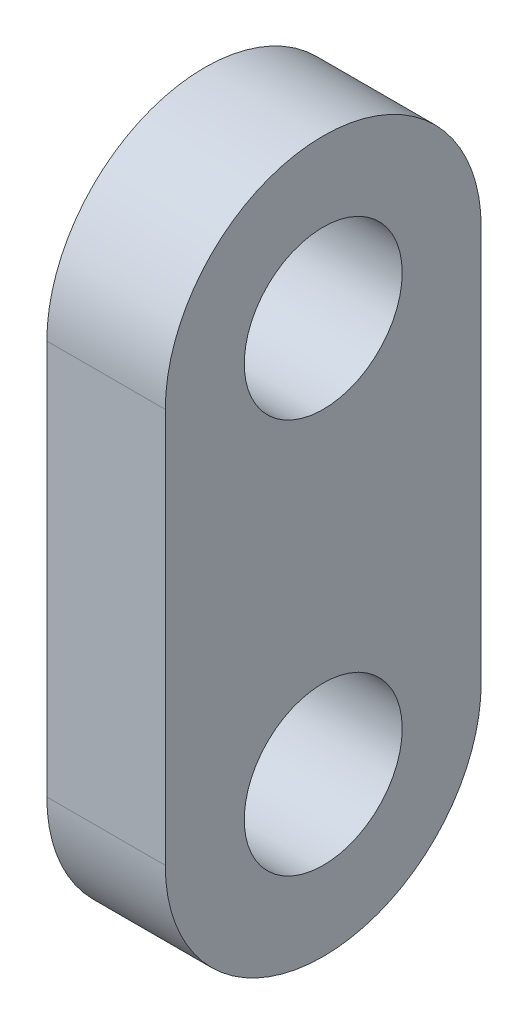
from build123d import *

# Parameters (mm, degrees)
SKETCH1_R           = 2
BOSS_EXTRUDE1_DEPTH = 3


with BuildPart() as part:
    # Sketch1 → Boss-Extrude1 (new body)
    with BuildSketch(Plane(origin=(0, 0, 0), x_dir=(0, 0, -1), z_dir=(1, 0, 0))):
        with BuildLine():
            Line((4, 10), (4, 0))
            ThreePointArc((4, 0), (0, -4), (-4, 0))
            Line((-4, 0), (-4, 10))
            ThreePointArc((-4, 10), (0, 14), (4, 10))
        make_face()
        Circle(SKETCH1_R, mode=Mode.SUBTRACT)
        with Locations((0, 10)):
            Circle(SKETCH1_R, mode=Mode.SUBTRACT)
    extrude(amount=BOSS_EXTRUDE1_DEPTH)


solid = part.part
